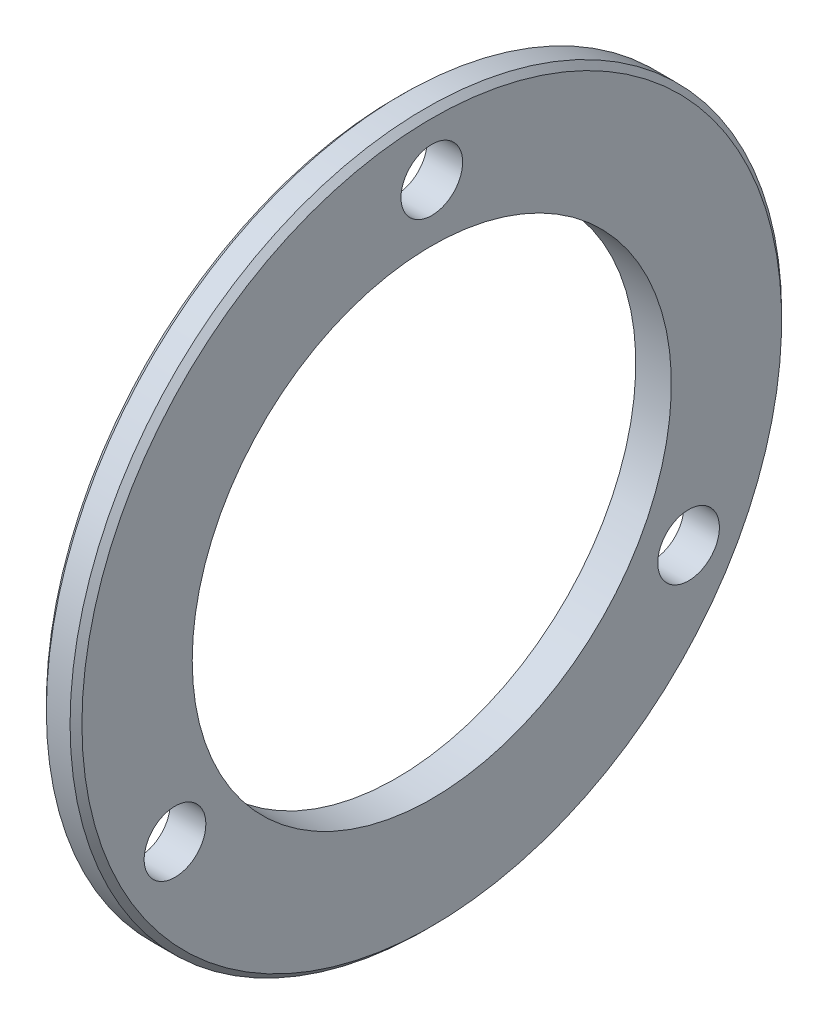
from build123d import *

# Parameters (mm, degrees)
SKIZZE1_W                        = 3
SKIZZE1_H                        = 9.8
F_5_2_5_2_DURCHMESSER_BOHRUNG1_D = 5.2
KREISMUSTER1_COUNT               = 3
FASE1_SIZE                       = 0.5


with BuildPart() as part:
    # Skizze1 → Rotation1 (revolve)
    with BuildSketch(Plane.XY, mode=Mode.PRIVATE) as rotation1_sk:
        with Locations((1.5, 25.1)):
            Rectangle(SKIZZE1_W, SKIZZE1_H)
    revolve(rotation1_sk.sketch.rotate(Axis((0, 0, 0), (1, 0, 0)), 90), axis=Axis((0, 0, 0), (1, 0, 0)))

    # 5.2 _5.2_ Durchmesser Bohrung1 (through all)
    with Locations(Plane(origin=(3, 0, 0), x_dir=(0, 0, -1), z_dir=(1, 0, 0))):
        with Locations((0, 25)):
            f_5_2_5_2_durchmesser_bohrung1 = Hole(F_5_2_5_2_DURCHMESSER_BOHRUNG1_D / 2)

    # Kreismuster1: 5.2 _5.2_ Durchmesser Bohrung1 ×3 about axis
    kreismuster1_axis = Axis((0, 0, 0), (1, 0, 0))
    for i in range(1, KREISMUSTER1_COUNT):
        add(f_5_2_5_2_durchmesser_bohrung1.rotate(kreismuster1_axis, i * 360 / KREISMUSTER1_COUNT), mode=Mode.SUBTRACT)

    # Fase1
    fase1_edges = [part.edges().sort_by_distance(p)[0] for p in [
        (0, 0, -30),
        (3, 0, -30),
    ]]
    chamfer(fase1_edges, length=FASE1_SIZE)


solid = part.part
